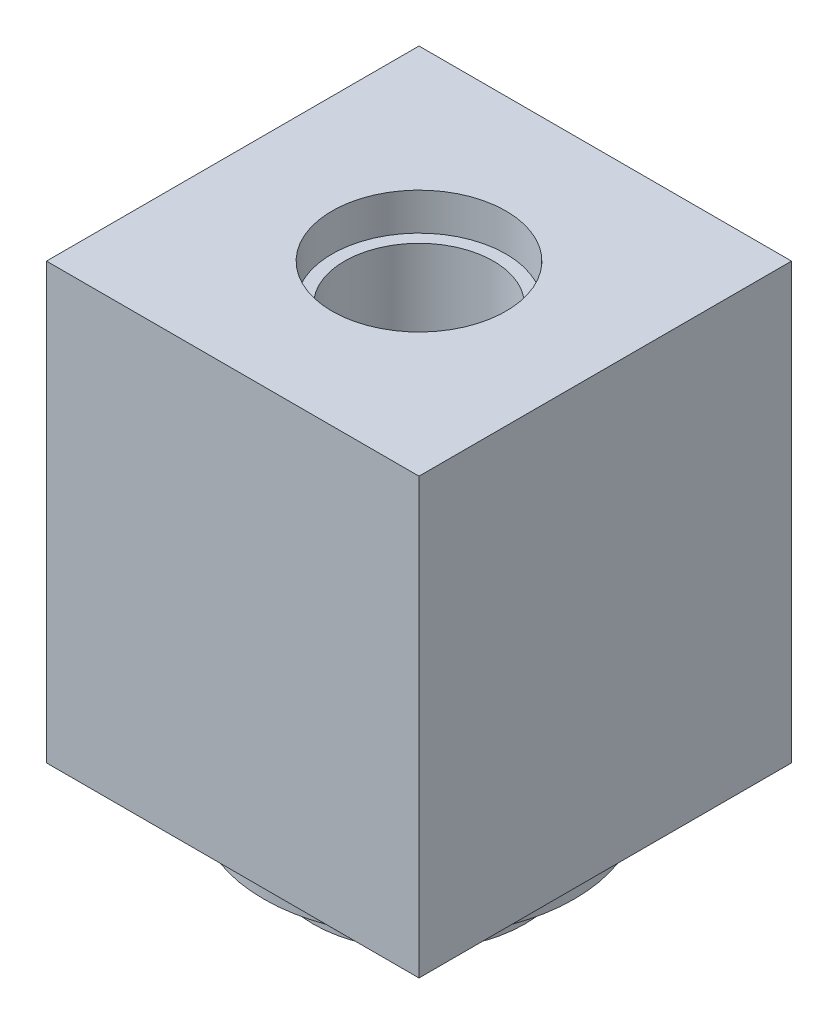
ISO-10303-21;
HEADER;
FILE_DESCRIPTION(('STEP AP214'),'2;1');
FILE_NAME('part.step','',(''),(''),'','','');
FILE_SCHEMA(('AUTOMOTIVE_DESIGN { 1 0 10303 214 1 1 1 1 }'));
ENDSEC;
DATA;
#1=APPLICATION_CONTEXT('core data for automotive mechanical design processes');
#2=APPLICATION_PROTOCOL_DEFINITION('international standard','automotive_design',2000,#1);
#3=PRODUCT_CONTEXT('',#1,'mechanical');
#4=PRODUCT('Part','Part','',(#3));
#5=PRODUCT_RELATED_PRODUCT_CATEGORY('part','',(#4));
#6=PRODUCT_DEFINITION_FORMATION('','',#4);
#7=PRODUCT_DEFINITION_CONTEXT('part definition',#1,'design');
#8=PRODUCT_DEFINITION('design','',#6,#7);
#9=PRODUCT_DEFINITION_SHAPE('','',#8);
#10=(LENGTH_UNIT() NAMED_UNIT(*) SI_UNIT(.MILLI.,.METRE.));
#11=(NAMED_UNIT(*) PLANE_ANGLE_UNIT() SI_UNIT($,.RADIAN.));
#12=(NAMED_UNIT(*) SI_UNIT($,.STERADIAN.) SOLID_ANGLE_UNIT());
#13=UNCERTAINTY_MEASURE_WITH_UNIT(LENGTH_MEASURE(1.E-05),#10,'distance_accuracy_value','');
#14=(GEOMETRIC_REPRESENTATION_CONTEXT(3) GLOBAL_UNCERTAINTY_ASSIGNED_CONTEXT((#13)) GLOBAL_UNIT_ASSIGNED_CONTEXT((#10,
#11,#12)) REPRESENTATION_CONTEXT('',''));
#15=CARTESIAN_POINT('',(0.,0.,0.));
#16=DIRECTION('',(0.,0.,1.));
#17=DIRECTION('',(1.,0.,0.));
#18=AXIS2_PLACEMENT_3D('',#15,#16,#17);
#19=CARTESIAN_POINT('',(-15.,17.5,0.));
#20=DIRECTION('',(-1.,0.,0.));
#21=DIRECTION('',(0.,0.,1.));
#22=AXIS2_PLACEMENT_3D('',#19,#20,#21);
#23=CYLINDRICAL_SURFACE('',#22,3.);
#24=CARTESIAN_POINT('',(-12.,17.5,0.));
#25=DIRECTION('',(-1.,0.,0.));
#26=DIRECTION('',(0.,0.,1.));
#27=AXIS2_PLACEMENT_3D('',#24,#25,#26);
#28=CIRCLE('',#27,3.);
#29=CARTESIAN_POINT('',(-12.,17.5,3.));
#30=VERTEX_POINT('',#29);
#31=EDGE_CURVE('E12',#30,#30,#28,.T.);
#32=ORIENTED_EDGE('',*,*,#31,.T.);
#33=EDGE_LOOP('',(#32));
#34=FACE_BOUND('',#33,.T.);
#35=CARTESIAN_POINT('',(-5.19615242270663,17.5,3.));
#36=CARTESIAN_POINT('',(-5.19615338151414,17.5782002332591,2.99999910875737));
#37=CARTESIAN_POINT('',(-5.19792581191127,17.6564099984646,2.99693611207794));
#38=CARTESIAN_POINT('',(-5.20493931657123,17.8122080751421,2.98473565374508));
#39=CARTESIAN_POINT('',(-5.21018200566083,17.8897960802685,2.97559536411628));
#40=CARTESIAN_POINT('',(-5.23088200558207,18.1209440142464,2.9391691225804));
#41=CARTESIAN_POINT('',(-5.25131076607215,18.2727509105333,2.902878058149));
#42=CARTESIAN_POINT('',(-5.3024774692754,18.5663916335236,2.80829998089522));
#43=CARTESIAN_POINT('',(-5.33316051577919,18.7082738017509,2.75012989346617));
#44=CARTESIAN_POINT('',(-5.40128072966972,18.9802627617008,2.61380253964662));
#45=CARTESIAN_POINT('',(-5.43871826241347,19.1103689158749,2.53564419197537));
#46=CARTESIAN_POINT('',(-5.51990583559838,19.3669201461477,2.35399963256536));
#47=CARTESIAN_POINT('',(-5.56392184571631,19.4921782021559,2.24895611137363));
#48=CARTESIAN_POINT('',(-5.651159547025,19.7242243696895,2.01976141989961));
#49=CARTESIAN_POINT('',(-5.69438083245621,19.8310032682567,1.89560077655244));
#50=CARTESIAN_POINT('',(-5.77864428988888,20.0301016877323,1.62146869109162));
#51=CARTESIAN_POINT('',(-5.81934318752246,20.1209613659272,1.47032156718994));
#52=CARTESIAN_POINT('',(-5.89052268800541,20.2754224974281,1.15247107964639));
#53=CARTESIAN_POINT('',(-5.92100973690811,20.3390411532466,0.985777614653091));
#54=CARTESIAN_POINT('',(-5.96641383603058,20.4325139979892,0.654134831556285));
#55=CARTESIAN_POINT('',(-5.98228440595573,20.4644485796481,0.489905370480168));
#56=CARTESIAN_POINT('',(-6.00022751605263,20.500498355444,0.157711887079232));
#57=CARTESIAN_POINT('',(-6.00230840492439,20.5046303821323,-0.0102498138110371));
#58=CARTESIAN_POINT('',(-5.9928894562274,20.4857599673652,-0.32949757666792));
#59=CARTESIAN_POINT('',(-5.98255487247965,20.465085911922,-0.480963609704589));
#60=CARTESIAN_POINT('',(-5.9512273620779,20.4013575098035,-0.77794130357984));
#61=CARTESIAN_POINT('',(-5.93023363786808,20.3583014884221,-0.92345251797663));
#62=CARTESIAN_POINT('',(-5.87914748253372,20.2507521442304,-1.20692822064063));
#63=CARTESIAN_POINT('',(-5.8489331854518,20.1859704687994,-1.34476044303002));
#64=CARTESIAN_POINT('',(-5.78212944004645,20.0372103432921,-1.60793023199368));
#65=CARTESIAN_POINT('',(-5.74553771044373,19.9532250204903,-1.73326330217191));
#66=CARTESIAN_POINT('',(-5.66533158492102,19.7593115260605,-1.98052168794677));
#67=CARTESIAN_POINT('',(-5.62138031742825,19.6476814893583,-2.10100497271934));
#68=CARTESIAN_POINT('',(-5.53363118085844,19.4062402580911,-2.32231036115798));
#69=CARTESIAN_POINT('',(-5.48983345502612,19.2764152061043,-2.42311733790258));
#70=CARTESIAN_POINT('',(-5.40432084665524,18.9920178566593,-2.6085269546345));
#71=CARTESIAN_POINT('',(-5.36291485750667,18.836397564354,-2.691694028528));
#72=CARTESIAN_POINT('',(-5.30915194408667,18.5924369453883,-2.79542837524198));
#73=CARTESIAN_POINT('',(-5.2926194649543,18.5093436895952,-2.82650797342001));
#74=CARTESIAN_POINT('',(-5.26298473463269,18.3401913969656,-2.88131297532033));
#75=CARTESIAN_POINT('',(-5.24988036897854,18.2541342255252,-2.90504291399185));
#76=CARTESIAN_POINT('',(-5.22855455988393,18.086628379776,-2.94323927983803));
#77=CARTESIAN_POINT('',(-5.22002982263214,18.0053505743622,-2.95828810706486));
#78=CARTESIAN_POINT('',(-5.20672737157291,17.8415647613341,-2.98163903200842));
#79=CARTESIAN_POINT('',(-5.20194770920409,17.7590574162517,-2.98994463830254));
#80=CARTESIAN_POINT('',(-5.19633662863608,17.5935289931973,-2.99968663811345));
#81=CARTESIAN_POINT('',(-5.19550374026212,17.5105081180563,-3.00112558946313));
#82=CARTESIAN_POINT('',(-5.19780953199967,17.3447135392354,-2.99712742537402));
#83=CARTESIAN_POINT('',(-5.20094794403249,17.2619398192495,-2.99169077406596));
#84=CARTESIAN_POINT('',(-5.21504493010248,17.0331408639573,-2.96710135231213));
#85=CARTESIAN_POINT('',(-5.23019160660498,16.8880891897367,-2.9405616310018));
#86=CARTESIAN_POINT('',(-5.27081666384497,16.6048690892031,-2.86709067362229));
#87=CARTESIAN_POINT('',(-5.29629839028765,16.4667029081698,-2.82015283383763));
#88=CARTESIAN_POINT('',(-5.35608780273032,16.1937738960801,-2.70494224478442));
#89=CARTESIAN_POINT('',(-5.3907496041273,16.0594650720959,-2.63578205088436));
#90=CARTESIAN_POINT('',(-5.46468327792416,15.803590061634,-2.47886133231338));
#91=CARTESIAN_POINT('',(-5.50395751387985,15.6820304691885,-2.3910912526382));
#92=CARTESIAN_POINT('',(-5.58864005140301,15.4390643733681,-2.18651145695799));
#93=CARTESIAN_POINT('',(-5.63419752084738,15.3196087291,-2.067435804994));
#94=CARTESIAN_POINT('',(-5.72202702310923,15.1017631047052,-1.8102134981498));
#95=CARTESIAN_POINT('',(-5.76429794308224,15.0033802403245,-1.67206042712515));
#96=CARTESIAN_POINT('',(-5.84224085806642,14.8282788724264,-1.37560608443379));
#97=CARTESIAN_POINT('',(-5.87770925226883,14.7522006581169,-1.21686929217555));
#98=CARTESIAN_POINT('',(-5.93650064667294,14.6285862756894,-0.88656709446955));
#99=CARTESIAN_POINT('',(-5.95983430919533,14.581025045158,-0.715013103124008));
#100=CARTESIAN_POINT('',(-5.9900252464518,14.5198943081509,-0.380939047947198));
#101=CARTESIAN_POINT('',(-5.99819783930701,14.5036063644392,-0.219034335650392));
#102=CARTESIAN_POINT('',(-6.00126390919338,14.4974702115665,0.105377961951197));
#103=CARTESIAN_POINT('',(-5.99616203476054,14.5076127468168,0.267885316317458));
#104=CARTESIAN_POINT('',(-5.97401907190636,14.5522491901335,0.577613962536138));
#105=CARTESIAN_POINT('',(-5.95778686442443,14.5850944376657,0.725136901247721));
#106=CARTESIAN_POINT('',(-5.91576278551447,14.6719811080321,1.0123379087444));
#107=CARTESIAN_POINT('',(-5.88996954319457,14.7260255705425,1.15201484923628));
#108=CARTESIAN_POINT('',(-5.829778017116,14.8561807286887,1.42627001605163));
#109=CARTESIAN_POINT('',(-5.79505887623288,14.9331363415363,1.56037465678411));
#110=CARTESIAN_POINT('',(-5.7206436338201,15.1058754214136,1.81432469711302));
#111=CARTESIAN_POINT('',(-5.68094524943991,15.2016675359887,1.93416350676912));
#112=CARTESIAN_POINT('',(-5.5958597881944,15.4203847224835,2.16873884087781));
#113=CARTESIAN_POINT('',(-5.55029975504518,15.5450613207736,2.28178066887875));
#114=CARTESIAN_POINT('',(-5.46188649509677,15.8123783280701,2.48600225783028));
#115=CARTESIAN_POINT('',(-5.41903568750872,15.9550344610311,2.57716267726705));
#116=CARTESIAN_POINT('',(-5.36004774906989,16.1825317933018,2.69665559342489));
#117=CARTESIAN_POINT('',(-5.34101219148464,16.2619758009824,2.73405408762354));
#118=CARTESIAN_POINT('',(-5.30572783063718,16.4243532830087,2.80191257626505));
#119=CARTESIAN_POINT('',(-5.28947759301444,16.507284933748,2.83237614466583));
#120=CARTESIAN_POINT('',(-5.26045215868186,16.6758447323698,2.88592624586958));
#121=CARTESIAN_POINT('',(-5.24766803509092,16.7614653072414,2.90903175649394));
#122=CARTESIAN_POINT('',(-5.22608869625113,16.9348552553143,2.94762428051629));
#123=CARTESIAN_POINT('',(-5.21729069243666,17.0226230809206,2.9631166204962));
#124=CARTESIAN_POINT('',(-5.20588528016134,17.1753988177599,2.9830938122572));
#125=CARTESIAN_POINT('',(-5.20224442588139,17.240094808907,2.9894274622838));
#126=CARTESIAN_POINT('',(-5.19737751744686,17.3698583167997,2.99788106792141));
#127=CARTESIAN_POINT('',(-5.1961516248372,17.4349258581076,3.00000074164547));
#128=CARTESIAN_POINT('',(-5.19615242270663,17.5,3.));
#129=B_SPLINE_CURVE_WITH_KNOTS('',3,(#35,#36,#37,#38,#39,#40,#41,#42,#43,#44,#45,#46,#47,#48,
#49,#50,#51,#52,#53,#54,#55,#56,#57,#58,#59,#60,#61,#62,#63,#64,#65,#66,#67,#68,#69,#70,#71,#72,
#73,#74,#75,#76,#77,#78,#79,#80,#81,#82,#83,#84,#85,#86,#87,#88,#89,#90,#91,#92,#93,#94,#95,#96,
#97,#98,#99,#100,#101,#102,#103,#104,#105,#106,#107,#108,#109,#110,#111,#112,#113,#114,#115,
#116,#117,#118,#119,#120,#121,#122,#123,#124,#125,#126,#127,#128),.UNSPECIFIED.,.T.,.F.,(4,2,2,
2,2,2,2,2,2,2,2,2,2,2,2,2,2,2,2,2,2,2,2,2,2,2,2,2,2,2,2,2,2,2,2,2,2,2,2,2,2,2,2,2,2,2,4),(0.,
0.234529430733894,0.469168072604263,0.938850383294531,1.40605749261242,1.87328988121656,
2.37905864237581,2.88507883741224,3.42520847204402,3.96499651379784,4.46637625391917,
4.96745241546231,5.42495462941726,5.88249108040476,6.34635774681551,6.81039068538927,
7.31828744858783,7.82657315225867,8.36713695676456,8.63752916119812,8.90775419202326,
9.15669600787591,9.40550821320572,9.65422772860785,9.90293045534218,10.3454331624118,
10.7880792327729,11.2512265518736,11.7146122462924,12.2364099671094,12.758383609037,
13.29413310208,13.8294110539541,14.3155757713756,14.8015702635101,15.2555404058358,
15.7095756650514,16.1830301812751,16.6567025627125,17.177514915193,17.6987859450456,
17.9680115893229,18.2370981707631,18.5054849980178,18.7736837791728,18.9688338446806,
19.1639969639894),.UNSPECIFIED.);
#130=CARTESIAN_POINT('',(-5.19615242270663,17.5,3.));
#131=VERTEX_POINT('',#130);
#132=EDGE_CURVE('E129',#131,#131,#129,.T.);
#133=ORIENTED_EDGE('',*,*,#132,.F.);
#134=EDGE_LOOP('',(#133));
#135=FACE_BOUND('',#134,.T.);
#136=ADVANCED_FACE('F34',(#34,#135),#23,.F.);
#137=CARTESIAN_POINT('',(0.,-7.,0.));
#138=DIRECTION('',(0.,1.,0.));
#139=DIRECTION('',(0.,0.,1.));
#140=AXIS2_PLACEMENT_3D('',#137,#138,#139);
#141=CYLINDRICAL_SURFACE('',#140,6.);
#142=ORIENTED_EDGE('',*,*,#132,.T.);
#143=EDGE_LOOP('',(#142));
#144=FACE_BOUND('',#143,.T.);
#145=CARTESIAN_POINT('',(0.,0.866025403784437,0.));
#146=DIRECTION('',(0.,-1.,0.));
#147=DIRECTION('',(0.,0.,-1.));
#148=AXIS2_PLACEMENT_3D('',#145,#146,#147);
#149=CIRCLE('',#148,6.);
#150=CARTESIAN_POINT('',(0.,0.866025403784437,-6.));
#151=VERTEX_POINT('',#150);
#152=EDGE_CURVE('E121',#151,#151,#149,.F.);
#153=ORIENTED_EDGE('',*,*,#152,.F.);
#154=EDGE_LOOP('',(#153));
#155=FACE_BOUND('',#154,.T.);
#156=CARTESIAN_POINT('',(0.,32.,0.));
#157=DIRECTION('',(0.,1.,0.));
#158=DIRECTION('',(0.,0.,1.));
#159=AXIS2_PLACEMENT_3D('',#156,#157,#158);
#160=CIRCLE('',#159,6.);
#161=CARTESIAN_POINT('',(0.,32.,6.));
#162=VERTEX_POINT('',#161);
#163=EDGE_CURVE('E125',#162,#162,#160,.F.);
#164=ORIENTED_EDGE('',*,*,#163,.F.);
#165=EDGE_LOOP('',(#164));
#166=FACE_BOUND('',#165,.T.);
#167=ADVANCED_FACE('F137',(#144,#155,#166),#141,.F.);
#168=CARTESIAN_POINT('',(0.,-7.,0.));
#169=DIRECTION('',(0.,1.,0.));
#170=DIRECTION('',(0.,0.,1.));
#171=AXIS2_PLACEMENT_3D('',#168,#169,#170);
#172=CYLINDRICAL_SURFACE('',#171,12.5);
#173=CARTESIAN_POINT('',(0.,-3.25,0.));
#174=DIRECTION('',(0.,-1.,0.));
#175=DIRECTION('',(0.,0.,-1.));
#176=AXIS2_PLACEMENT_3D('',#173,#174,#175);
#177=CIRCLE('',#176,12.5);
#178=CARTESIAN_POINT('',(0.,-3.25,-12.5));
#179=VERTEX_POINT('',#178);
#180=EDGE_CURVE('E118',#179,#179,#177,.F.);
#181=ORIENTED_EDGE('',*,*,#180,.T.);
#182=EDGE_LOOP('',(#181));
#183=FACE_BOUND('',#182,.T.);
#184=CARTESIAN_POINT('',(0.,0.,0.));
#185=DIRECTION('',(0.,1.,0.));
#186=DIRECTION('',(0.,0.,1.));
#187=AXIS2_PLACEMENT_3D('',#184,#185,#186);
#188=CIRCLE('',#187,12.5);
#189=CARTESIAN_POINT('',(0.,0.,12.5));
#190=VERTEX_POINT('',#189);
#191=EDGE_CURVE('E112',#190,#190,#188,.F.);
#192=ORIENTED_EDGE('',*,*,#191,.T.);
#193=EDGE_LOOP('',(#192));
#194=FACE_BOUND('',#193,.T.);
#195=ADVANCED_FACE('F200',(#183,#194),#172,.T.);
#196=CARTESIAN_POINT('',(-15.,0.,15.));
#197=DIRECTION('',(0.,1.,0.));
#198=DIRECTION('',(0.,0.,1.));
#199=AXIS2_PLACEMENT_3D('',#196,#197,#198);
#200=PLANE('',#199);
#201=DIRECTION('',(0.,0.,1.));
#202=VECTOR('',#201,1.);
#203=CARTESIAN_POINT('',(-15.,0.,-15.));
#204=LINE('',#203,#202);
#205=CARTESIAN_POINT('',(-15.,0.,-15.));
#206=VERTEX_POINT('',#205);
#207=CARTESIAN_POINT('',(-15.,0.,15.));
#208=VERTEX_POINT('',#207);
#209=EDGE_CURVE('E102',#206,#208,#204,.T.);
#210=ORIENTED_EDGE('',*,*,#209,.F.);
#211=DIRECTION('',(-1.,0.,0.));
#212=VECTOR('',#211,1.);
#213=CARTESIAN_POINT('',(-15.,0.,-15.));
#214=LINE('',#213,#212);
#215=CARTESIAN_POINT('',(15.,0.,-15.));
#216=VERTEX_POINT('',#215);
#217=EDGE_CURVE('E74',#216,#206,#214,.T.);
#218=ORIENTED_EDGE('',*,*,#217,.F.);
#219=DIRECTION('',(0.,0.,-1.));
#220=VECTOR('',#219,1.);
#221=CARTESIAN_POINT('',(15.,0.,-15.));
#222=LINE('',#221,#220);
#223=CARTESIAN_POINT('',(15.,0.,15.));
#224=VERTEX_POINT('',#223);
#225=EDGE_CURVE('E68',#224,#216,#222,.T.);
#226=ORIENTED_EDGE('',*,*,#225,.F.);
#227=DIRECTION('',(1.,0.,0.));
#228=VECTOR('',#227,1.);
#229=CARTESIAN_POINT('',(-15.,0.,15.));
#230=LINE('',#229,#228);
#231=EDGE_CURVE('E92',#208,#224,#230,.T.);
#232=ORIENTED_EDGE('',*,*,#231,.F.);
#233=EDGE_LOOP('',(#210,#218,#226,#232));
#234=FACE_BOUND('',#233,.T.);
#235=ORIENTED_EDGE('',*,*,#191,.F.);
#236=EDGE_LOOP('',(#235));
#237=FACE_BOUND('',#236,.T.);
#238=ADVANCED_FACE('F203',(#234,#237),#200,.F.);
#239=CARTESIAN_POINT('',(-15.,35.,-15.));
#240=DIRECTION('',(1.,0.,0.));
#241=DIRECTION('',(0.,0.,-1.));
#242=AXIS2_PLACEMENT_3D('',#239,#240,#241);
#243=PLANE('',#242);
#244=CARTESIAN_POINT('',(-15.,17.5,0.));
#245=DIRECTION('',(-1.,0.,0.));
#246=DIRECTION('',(0.,0.,1.));
#247=AXIS2_PLACEMENT_3D('',#244,#245,#246);
#248=CIRCLE('',#247,7.);
#249=CARTESIAN_POINT('',(-15.,17.5,7.));
#250=VERTEX_POINT('',#249);
#251=EDGE_CURVE('E355',#250,#250,#248,.T.);
#252=ORIENTED_EDGE('',*,*,#251,.F.);
#253=EDGE_LOOP('',(#252));
#254=FACE_BOUND('',#253,.T.);
#255=ORIENTED_EDGE('',*,*,#209,.T.);
#256=DIRECTION('',(0.,-1.,0.));
#257=VECTOR('',#256,1.);
#258=CARTESIAN_POINT('',(-15.,35.,15.));
#259=LINE('',#258,#257);
#260=CARTESIAN_POINT('',(-15.,35.,15.));
#261=VERTEX_POINT('',#260);
#262=EDGE_CURVE('E93',#261,#208,#259,.T.);
#263=ORIENTED_EDGE('',*,*,#262,.F.);
#264=DIRECTION('',(0.,0.,1.));
#265=VECTOR('',#264,1.);
#266=CARTESIAN_POINT('',(-15.,35.,-15.));
#267=LINE('',#266,#265);
#268=CARTESIAN_POINT('',(-15.,35.,-15.));
#269=VERTEX_POINT('',#268);
#270=EDGE_CURVE('E87',#269,#261,#267,.T.);
#271=ORIENTED_EDGE('',*,*,#270,.F.);
#272=DIRECTION('',(0.,-1.,0.));
#273=VECTOR('',#272,1.);
#274=CARTESIAN_POINT('',(-15.,35.,-15.));
#275=LINE('',#274,#273);
#276=EDGE_CURVE('E98',#269,#206,#275,.T.);
#277=ORIENTED_EDGE('',*,*,#276,.T.);
#278=EDGE_LOOP('',(#255,#263,#271,#277));
#279=FACE_BOUND('',#278,.T.);
#280=ADVANCED_FACE('F210',(#254,#279),#243,.F.);
#281=CARTESIAN_POINT('',(-15.,35.,15.));
#282=DIRECTION('',(0.,0.,-1.));
#283=DIRECTION('',(-1.,0.,0.));
#284=AXIS2_PLACEMENT_3D('',#281,#282,#283);
#285=PLANE('',#284);
#286=ORIENTED_EDGE('',*,*,#231,.T.);
#287=DIRECTION('',(0.,-1.,0.));
#288=VECTOR('',#287,1.);
#289=CARTESIAN_POINT('',(15.,35.,15.));
#290=LINE('',#289,#288);
#291=CARTESIAN_POINT('',(15.,35.,15.));
#292=VERTEX_POINT('',#291);
#293=EDGE_CURVE('E90',#292,#224,#290,.T.);
#294=ORIENTED_EDGE('',*,*,#293,.F.);
#295=DIRECTION('',(1.,0.,0.));
#296=VECTOR('',#295,1.);
#297=CARTESIAN_POINT('',(-15.,35.,15.));
#298=LINE('',#297,#296);
#299=EDGE_CURVE('E82',#261,#292,#298,.T.);
#300=ORIENTED_EDGE('',*,*,#299,.F.);
#301=ORIENTED_EDGE('',*,*,#262,.T.);
#302=EDGE_LOOP('',(#286,#294,#300,#301));
#303=FACE_BOUND('',#302,.T.);
#304=ADVANCED_FACE('F91',(#303),#285,.F.);
#305=CARTESIAN_POINT('',(15.,35.,-15.));
#306=DIRECTION('',(-1.,0.,0.));
#307=DIRECTION('',(0.,0.,1.));
#308=AXIS2_PLACEMENT_3D('',#305,#306,#307);
#309=PLANE('',#308);
#310=ORIENTED_EDGE('',*,*,#225,.T.);
#311=DIRECTION('',(0.,-1.,0.));
#312=VECTOR('',#311,1.);
#313=CARTESIAN_POINT('',(15.,35.,-15.));
#314=LINE('',#313,#312);
#315=CARTESIAN_POINT('',(15.,35.,-15.));
#316=VERTEX_POINT('',#315);
#317=EDGE_CURVE('E94',#316,#216,#314,.T.);
#318=ORIENTED_EDGE('',*,*,#317,.F.);
#319=DIRECTION('',(0.,0.,-1.));
#320=VECTOR('',#319,1.);
#321=CARTESIAN_POINT('',(15.,35.,-15.));
#322=LINE('',#321,#320);
#323=EDGE_CURVE('E85',#292,#316,#322,.T.);
#324=ORIENTED_EDGE('',*,*,#323,.F.);
#325=ORIENTED_EDGE('',*,*,#293,.T.);
#326=EDGE_LOOP('',(#310,#318,#324,#325));
#327=FACE_BOUND('',#326,.T.);
#328=ADVANCED_FACE('F96',(#327),#309,.F.);
#329=CARTESIAN_POINT('',(-15.,35.,-15.));
#330=DIRECTION('',(0.,0.,1.));
#331=DIRECTION('',(1.,0.,0.));
#332=AXIS2_PLACEMENT_3D('',#329,#330,#331);
#333=PLANE('',#332);
#334=ORIENTED_EDGE('',*,*,#217,.T.);
#335=ORIENTED_EDGE('',*,*,#276,.F.);
#336=DIRECTION('',(-1.,0.,0.));
#337=VECTOR('',#336,1.);
#338=CARTESIAN_POINT('',(-15.,35.,-15.));
#339=LINE('',#338,#337);
#340=EDGE_CURVE('E51',#316,#269,#339,.T.);
#341=ORIENTED_EDGE('',*,*,#340,.F.);
#342=ORIENTED_EDGE('',*,*,#317,.T.);
#343=EDGE_LOOP('',(#334,#335,#341,#342));
#344=FACE_BOUND('',#343,.T.);
#345=ADVANCED_FACE('F207',(#344),#333,.F.);
#346=CARTESIAN_POINT('',(-15.,35.,15.));
#347=DIRECTION('',(0.,1.,0.));
#348=DIRECTION('',(0.,0.,1.));
#349=AXIS2_PLACEMENT_3D('',#346,#347,#348);
#350=PLANE('',#349);
#351=CARTESIAN_POINT('',(0.,35.,0.));
#352=DIRECTION('',(0.,1.,0.));
#353=DIRECTION('',(0.,0.,1.));
#354=AXIS2_PLACEMENT_3D('',#351,#352,#353);
#355=CIRCLE('',#354,7.);
#356=CARTESIAN_POINT('',(0.,35.,7.));
#357=VERTEX_POINT('',#356);
#358=EDGE_CURVE('E135',#357,#357,#355,.T.);
#359=ORIENTED_EDGE('',*,*,#358,.F.);
#360=EDGE_LOOP('',(#359));
#361=FACE_BOUND('',#360,.T.);
#362=ORIENTED_EDGE('',*,*,#270,.T.);
#363=ORIENTED_EDGE('',*,*,#299,.T.);
#364=ORIENTED_EDGE('',*,*,#323,.T.);
#365=ORIENTED_EDGE('',*,*,#340,.T.);
#366=EDGE_LOOP('',(#362,#363,#364,#365));
#367=FACE_BOUND('',#366,.T.);
#368=ADVANCED_FACE('F83',(#361,#367),#350,.T.);
#369=CARTESIAN_POINT('',(0.,-5.,0.));
#370=DIRECTION('',(0.,-1.,0.));
#371=DIRECTION('',(0.,0.,-1.));
#372=AXIS2_PLACEMENT_3D('',#369,#370,#371);
#373=PLANE('',#372);
#374=CARTESIAN_POINT('',(0.,-5.,0.));
#375=DIRECTION('',(0.,-1.,0.));
#376=DIRECTION('',(0.,0.,-1.));
#377=AXIS2_PLACEMENT_3D('',#374,#375,#376);
#378=CIRCLE('',#377,9.49999999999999);
#379=CARTESIAN_POINT('',(0.,-5.,-9.49999999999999));
#380=VERTEX_POINT('',#379);
#381=EDGE_CURVE('E115',#380,#380,#378,.T.);
#382=ORIENTED_EDGE('',*,*,#381,.T.);
#383=EDGE_LOOP('',(#382));
#384=FACE_BOUND('',#383,.T.);
#385=CARTESIAN_POINT('',(0.,-5.,0.));
#386=DIRECTION('',(0.,-1.,0.));
#387=DIRECTION('',(0.,0.,-1.));
#388=AXIS2_PLACEMENT_3D('',#385,#386,#387);
#389=CIRCLE('',#388,8.5);
#390=CARTESIAN_POINT('',(0.,-5.,-8.5));
#391=VERTEX_POINT('',#390);
#392=EDGE_CURVE('E105',#391,#391,#389,.T.);
#393=ORIENTED_EDGE('',*,*,#392,.F.);
#394=EDGE_LOOP('',(#393));
#395=FACE_BOUND('',#394,.T.);
#396=ADVANCED_FACE('F185',(#384,#395),#373,.T.);
#397=CARTESIAN_POINT('',(0.,-5.,0.));
#398=DIRECTION('',(0.,-1.,0.));
#399=DIRECTION('',(0.,0.,-1.));
#400=AXIS2_PLACEMENT_3D('',#397,#398,#399);
#401=CYLINDRICAL_SURFACE('',#400,8.5);
#402=ORIENTED_EDGE('',*,*,#392,.T.);
#403=EDGE_LOOP('',(#402));
#404=FACE_BOUND('',#403,.T.);
#405=CARTESIAN_POINT('',(0.,-7.,0.));
#406=DIRECTION('',(0.,-1.,0.));
#407=DIRECTION('',(0.,0.,-1.));
#408=AXIS2_PLACEMENT_3D('',#405,#406,#407);
#409=CIRCLE('',#408,8.5);
#410=CARTESIAN_POINT('',(0.,-7.,-8.5));
#411=VERTEX_POINT('',#410);
#412=EDGE_CURVE('E175',#411,#411,#409,.T.);
#413=ORIENTED_EDGE('',*,*,#412,.F.);
#414=EDGE_LOOP('',(#413));
#415=FACE_BOUND('',#414,.T.);
#416=ADVANCED_FACE('F183',(#404,#415),#401,.T.);
#417=CARTESIAN_POINT('',(0.,-7.,0.));
#418=DIRECTION('',(0.,-1.,0.));
#419=DIRECTION('',(0.,0.,-1.));
#420=AXIS2_PLACEMENT_3D('',#417,#418,#419);
#421=PLANE('',#420);
#422=CARTESIAN_POINT('',(0.,-7.,0.));
#423=DIRECTION('',(0.,-1.,0.));
#424=DIRECTION('',(0.,0.,-1.));
#425=AXIS2_PLACEMENT_3D('',#422,#423,#424);
#426=CIRCLE('',#425,7.5);
#427=CARTESIAN_POINT('',(0.,-7.,-7.5));
#428=VERTEX_POINT('',#427);
#429=EDGE_CURVE('E124',#428,#428,#426,.T.);
#430=ORIENTED_EDGE('',*,*,#429,.F.);
#431=EDGE_LOOP('',(#430));
#432=FACE_BOUND('',#431,.T.);
#433=ORIENTED_EDGE('',*,*,#412,.T.);
#434=EDGE_LOOP('',(#433));
#435=FACE_BOUND('',#434,.T.);
#436=ADVANCED_FACE('F181',(#432,#435),#421,.T.);
#437=CARTESIAN_POINT('',(0.,-5.,0.));
#438=DIRECTION('',(0.,1.,0.));
#439=DIRECTION('',(0.,0.,1.));
#440=AXIS2_PLACEMENT_3D('',#437,#438,#439);
#441=CONICAL_SURFACE('',#440,9.49999999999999,1.04272187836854);
#442=ORIENTED_EDGE('',*,*,#180,.F.);
#443=EDGE_LOOP('',(#442));
#444=FACE_BOUND('',#443,.T.);
#445=ORIENTED_EDGE('',*,*,#381,.F.);
#446=EDGE_LOOP('',(#445));
#447=FACE_BOUND('',#446,.T.);
#448=ADVANCED_FACE('F192',(#444,#447),#441,.T.);
#449=CARTESIAN_POINT('',(0.,0.,0.));
#450=DIRECTION('',(0.,-1.,0.));
#451=DIRECTION('',(0.,0.,-1.));
#452=AXIS2_PLACEMENT_3D('',#449,#450,#451);
#453=CONICAL_SURFACE('',#452,7.5,1.0471975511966);
#454=ORIENTED_EDGE('',*,*,#152,.T.);
#455=EDGE_LOOP('',(#454));
#456=FACE_BOUND('',#455,.T.);
#457=CARTESIAN_POINT('',(0.,0.,0.));
#458=DIRECTION('',(0.,-1.,0.));
#459=DIRECTION('',(0.,0.,-1.));
#460=AXIS2_PLACEMENT_3D('',#457,#458,#459);
#461=CIRCLE('',#460,7.5);
#462=CARTESIAN_POINT('',(0.,0.,-7.5));
#463=VERTEX_POINT('',#462);
#464=EDGE_CURVE('E172',#463,#463,#461,.T.);
#465=ORIENTED_EDGE('',*,*,#464,.T.);
#466=EDGE_LOOP('',(#465));
#467=FACE_BOUND('',#466,.T.);
#468=ADVANCED_FACE('F198',(#456,#467),#453,.F.);
#469=CARTESIAN_POINT('',(0.,-7.,0.));
#470=DIRECTION('',(0.,-1.,0.));
#471=DIRECTION('',(0.,0.,-1.));
#472=AXIS2_PLACEMENT_3D('',#469,#470,#471);
#473=CYLINDRICAL_SURFACE('',#472,7.5);
#474=ORIENTED_EDGE('',*,*,#464,.F.);
#475=EDGE_LOOP('',(#474));
#476=FACE_BOUND('',#475,.T.);
#477=ORIENTED_EDGE('',*,*,#429,.T.);
#478=EDGE_LOOP('',(#477));
#479=FACE_BOUND('',#478,.T.);
#480=ADVANCED_FACE('F151',(#476,#479),#473,.F.);
#481=CARTESIAN_POINT('',(0.,32.,0.));
#482=DIRECTION('',(0.,1.,0.));
#483=DIRECTION('',(0.,0.,1.));
#484=AXIS2_PLACEMENT_3D('',#481,#482,#483);
#485=PLANE('',#484);
#486=CARTESIAN_POINT('',(0.,32.,0.));
#487=DIRECTION('',(0.,1.,0.));
#488=DIRECTION('',(0.,0.,1.));
#489=AXIS2_PLACEMENT_3D('',#486,#487,#488);
#490=CIRCLE('',#489,7.);
#491=CARTESIAN_POINT('',(0.,32.,7.));
#492=VERTEX_POINT('',#491);
#493=EDGE_CURVE('E128',#492,#492,#490,.T.);
#494=ORIENTED_EDGE('',*,*,#493,.T.);
#495=EDGE_LOOP('',(#494));
#496=FACE_BOUND('',#495,.T.);
#497=ORIENTED_EDGE('',*,*,#163,.T.);
#498=EDGE_LOOP('',(#497));
#499=FACE_BOUND('',#498,.T.);
#500=ADVANCED_FACE('F148',(#496,#499),#485,.T.);
#501=CARTESIAN_POINT('',(0.,32.,0.));
#502=DIRECTION('',(0.,1.,0.));
#503=DIRECTION('',(0.,0.,1.));
#504=AXIS2_PLACEMENT_3D('',#501,#502,#503);
#505=CYLINDRICAL_SURFACE('',#504,7.);
#506=ORIENTED_EDGE('',*,*,#493,.F.);
#507=EDGE_LOOP('',(#506));
#508=FACE_BOUND('',#507,.T.);
#509=ORIENTED_EDGE('',*,*,#358,.T.);
#510=EDGE_LOOP('',(#509));
#511=FACE_BOUND('',#510,.T.);
#512=ADVANCED_FACE('F150',(#508,#511),#505,.F.);
#513=CARTESIAN_POINT('',(-13.,17.5,0.));
#514=DIRECTION('',(-1.,0.,0.));
#515=DIRECTION('',(0.,0.,1.));
#516=AXIS2_PLACEMENT_3D('',#513,#514,#515);
#517=PLANE('',#516);
#518=CARTESIAN_POINT('',(-13.,17.5,0.));
#519=DIRECTION('',(-1.,0.,0.));
#520=DIRECTION('',(0.,0.,1.));
#521=AXIS2_PLACEMENT_3D('',#518,#519,#520);
#522=CIRCLE('',#521,4.);
#523=CARTESIAN_POINT('',(-13.,17.5,4.));
#524=VERTEX_POINT('',#523);
#525=EDGE_CURVE('E43',#524,#524,#522,.F.);
#526=ORIENTED_EDGE('',*,*,#525,.T.);
#527=EDGE_LOOP('',(#526));
#528=FACE_BOUND('',#527,.T.);
#529=CARTESIAN_POINT('',(-13.,17.5,0.));
#530=DIRECTION('',(-1.,0.,0.));
#531=DIRECTION('',(0.,0.,1.));
#532=AXIS2_PLACEMENT_3D('',#529,#530,#531);
#533=CIRCLE('',#532,7.);
#534=CARTESIAN_POINT('',(-13.,17.5,7.));
#535=VERTEX_POINT('',#534);
#536=EDGE_CURVE('E136',#535,#535,#533,.T.);
#537=ORIENTED_EDGE('',*,*,#536,.T.);
#538=EDGE_LOOP('',(#537));
#539=FACE_BOUND('',#538,.T.);
#540=ADVANCED_FACE('F154',(#528,#539),#517,.T.);
#541=CARTESIAN_POINT('',(-13.,17.5,0.));
#542=DIRECTION('',(-1.,0.,0.));
#543=DIRECTION('',(0.,0.,1.));
#544=AXIS2_PLACEMENT_3D('',#541,#542,#543);
#545=CYLINDRICAL_SURFACE('',#544,7.);
#546=ORIENTED_EDGE('',*,*,#536,.F.);
#547=EDGE_LOOP('',(#546));
#548=FACE_BOUND('',#547,.T.);
#549=ORIENTED_EDGE('',*,*,#251,.T.);
#550=EDGE_LOOP('',(#549));
#551=FACE_BOUND('',#550,.T.);
#552=ADVANCED_FACE('F146',(#548,#551),#545,.F.);
#553=CARTESIAN_POINT('',(-13.,17.5,0.));
#554=DIRECTION('',(-1.,0.,0.));
#555=DIRECTION('',(0.,0.,1.));
#556=AXIS2_PLACEMENT_3D('',#553,#554,#555);
#557=CONICAL_SURFACE('',#556,4.,0.785398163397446);
#558=ORIENTED_EDGE('',*,*,#31,.F.);
#559=EDGE_LOOP('',(#558));
#560=FACE_BOUND('',#559,.T.);
#561=ORIENTED_EDGE('',*,*,#525,.F.);
#562=EDGE_LOOP('',(#561));
#563=FACE_BOUND('',#562,.T.);
#564=ADVANCED_FACE('F36',(#560,#563),#557,.F.);
#565=CLOSED_SHELL('',(#136,#167,#195,#238,#280,#304,#328,#345,#368,#396,#416,#436,#448,#468,
#480,#500,#512,#540,#552,#564));
#566=MANIFOLD_SOLID_BREP('B2',#565);
#567=ADVANCED_BREP_SHAPE_REPRESENTATION('',(#18,#566),#14);
#568=SHAPE_DEFINITION_REPRESENTATION(#9,#567);
ENDSEC;
END-ISO-10303-21;
